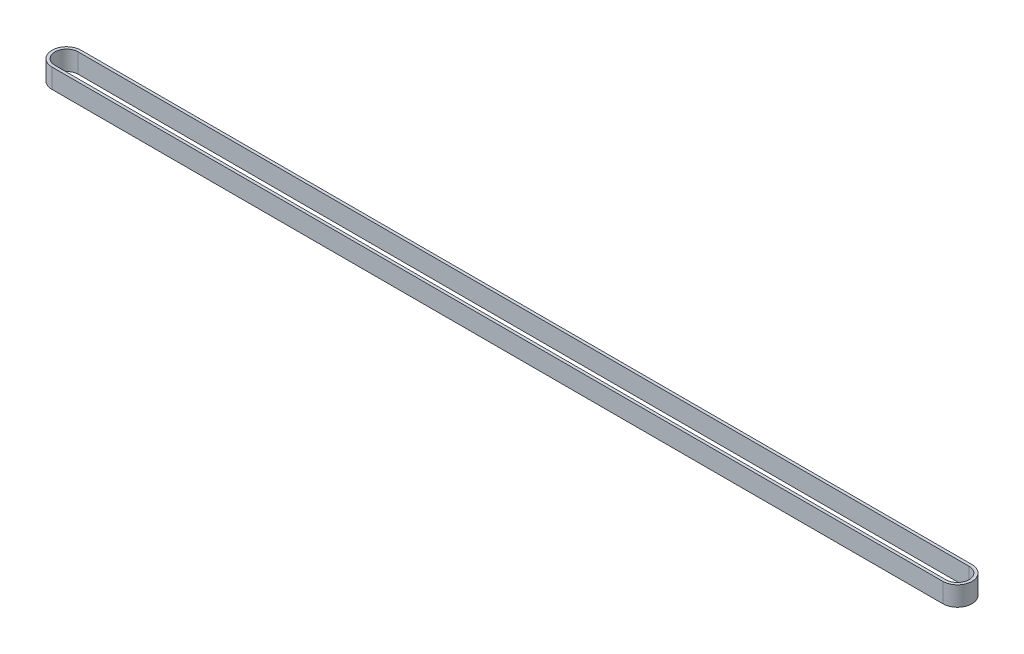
from build123d import *

# Parameters (mm, degrees)
AUFSATZ_LINEAR_AUSTRAGEN1_DEPTH = 5


with BuildPart() as part:
    # Skizze1 → Aufsatz-Linear austragen1 (new, symmetric)
    with BuildSketch(Plane(origin=(0, 0, 0), x_dir=(1, 0, 0), z_dir=(0, 1, 0))):
        with BuildLine():
            Line((458.8, -7.5), (0, -7.5))
            ThreePointArc((0, -7.5), (-7.5, 0), (0, 7.5))
            Line((0, 7.5), (458.8, 7.5))
            ThreePointArc((458.8, 7.5), (466.3, 0), (458.8, -7.5))
        make_face()
        with BuildLine():
            Line((458.8, -6), (0, -6))
            ThreePointArc((0, -6), (-6, 0), (0, 6))
            Line((0, 6), (458.8, 6))
            ThreePointArc((458.8, 6), (464.8, 0), (458.8, -6))
        make_face(mode=Mode.SUBTRACT)
    extrude(amount=AUFSATZ_LINEAR_AUSTRAGEN1_DEPTH, both=True)


solid = part.part
